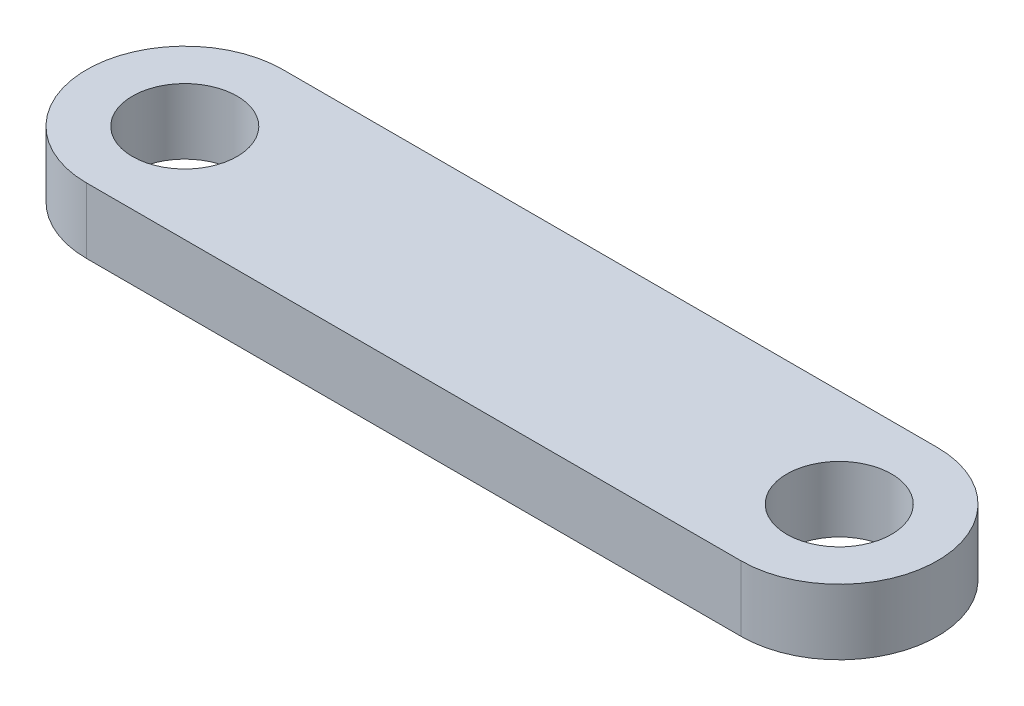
from build123d import *

# Parameters (mm, degrees)
SKETCH1_R           = 4
BOSS_EXTRUDE1_DEPTH = 5


with BuildPart() as part:
    # Sketch1 → Boss-Extrude1 (new body)
    with BuildSketch(Plane(origin=(0, 0, 0), x_dir=(1, 0, 0), z_dir=(0, 1, 0))):
        with BuildLine():
            Line((0, 7.5), (50, 7.5))
            ThreePointArc((50, 7.5), (57.5, 0), (50, -7.5))
            Line((50, -7.5), (0, -7.5))
            ThreePointArc((0, -7.5), (-7.5, 0), (0, 7.5))
        make_face()
        with Locations(Location((0, 0, 0), (0, 0, 270))):
            Circle(SKETCH1_R, mode=Mode.SUBTRACT)
        with Locations(Location((50, 0, 0), (0, 0, 270))):
            Circle(SKETCH1_R, mode=Mode.SUBTRACT)
    extrude(amount=BOSS_EXTRUDE1_DEPTH)


solid = part.part
